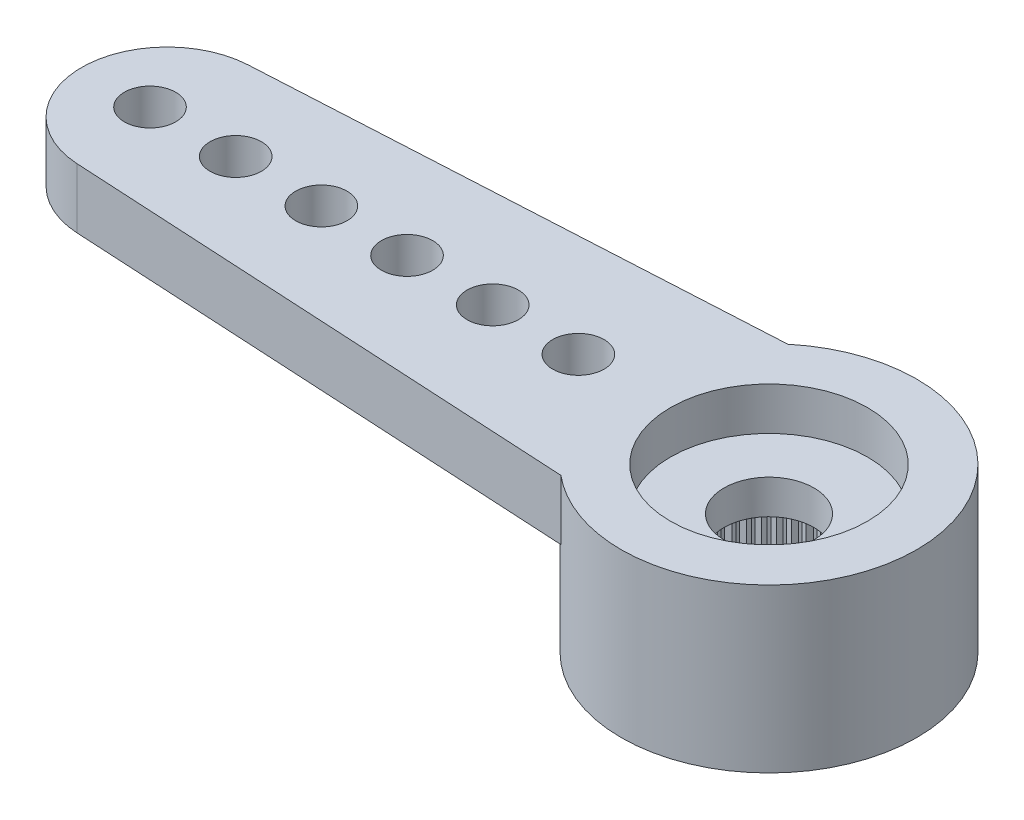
from build123d import *

# Parameters (mm, degrees)
RESSALTO_EXTRUS_O1_DEPTH = 1.4
ESBO_O2_R                = 3.45
RESSALTO_EXTRUS_O2_DEPTH = 2.4
FURO4_D                  = 1.2
PADR_O_LINEAR1_COUNT     = 6
PADR_O_LINEAR1_PITCH     = 2
FURO1_D                  = 4.95
FURO1_DEPTH              = 2
FURO2_D                  = 4.6
FURO2_DEPTH              = 1
FURO3_D                  = 2.1
RESSALTO_EXTRUS_O3_START = -2
RESSALTO_EXTRUS_O3_DEPTH = 2
PADR_OCIRCULAR1_COUNT    = 60


with BuildPart() as part:
    # Esbo_o1 → Ressalto-extrus_o1 (new body)
    with BuildSketch(Plane(origin=(0, 0, 0), x_dir=(1, 0, 0), z_dir=(0, 1, 0))):
        with BuildLine():
            Line((-14.159121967, 1.99702088), (-2.209072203, 2.65))
            ThreePointArc((-2.209072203, 2.65), (3.45, 0), (-2.209072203, -2.65))
            Line((-2.209072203, -2.65), (-14.159121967, -1.99702088))
            ThreePointArc((-14.159121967, -1.99702088), (-16.05, 0), (-14.159121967, 1.99702088))
        make_face()
    extrude(amount=-RESSALTO_EXTRUS_O1_DEPTH)

    # Esbo_o2 → Ressalto-extrus_o2 (add)
    with BuildSketch(Plane.XZ.offset(1.4)):
        with Locations(Location((0, 0, 0), (0, 0, 90))):
            Circle(ESBO_O2_R)
    extrude(amount=RESSALTO_EXTRUS_O2_DEPTH)

    # Furo4 (through all)
    with Locations(Plane(origin=(0, 0, 0), x_dir=(1, 0, 0), z_dir=(0, 1, 0))):
        with Locations((-14.45, 0)):
            furo4 = Hole(FURO4_D / 2)

    # Padr_o linear1: Furo4 ×6
    with Locations(*[(i * PADR_O_LINEAR1_PITCH, 0, 0) for i in range(1, PADR_O_LINEAR1_COUNT)]):
        add(furo4, mode=Mode.SUBTRACT)

    # Furo1
    with Locations(Plane(origin=(0, -3.8, 0), x_dir=(-1, 0, 0), z_dir=(0, -1, 0))):
        with Locations((0, 0)):
            Hole(FURO1_D / 2, depth=FURO1_DEPTH)

    # Furo2
    with Locations(Plane(origin=(0, 0, 0), x_dir=(1, 0, 0), z_dir=(0, 1, 0))):
        with Locations((0, 0)):
            Hole(FURO2_D / 2, depth=FURO2_DEPTH)

    # Furo3 (through all)
    with Locations(Plane(origin=(0, 0, 0), x_dir=(1, 0, 0), z_dir=(0, 1, 0))):
        with Locations((0, 0)):
            Hole(FURO3_D / 2)

    # Esbo_o11 → Ressalto-extrus_o3 (add)
    with BuildSketch(Plane.XZ.offset(3.8).offset(RESSALTO_EXTRUS_O3_START)):
        with BuildLine():
            Line((-0.098056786, 2.473056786), (0, 2.375))
            Line((0, 2.375), (0.098056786, 2.473056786))
            ThreePointArc((0.098056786, 2.473056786), (0, 2.475), (-0.098056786, 2.473056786))
        make_face()
    ressalto_extrus_o3 = extrude(amount=RESSALTO_EXTRUS_O3_DEPTH)

    # Padr_oCircular1: Ressalto-extrus_o3 ×60 about axis
    padr_ocircular1_axis = Axis((0, 0, 0), (0, 1, 0))
    for i in range(1, PADR_OCIRCULAR1_COUNT):
        add(ressalto_extrus_o3.rotate(padr_ocircular1_axis, i * 360 / PADR_OCIRCULAR1_COUNT))


solid = part.part
